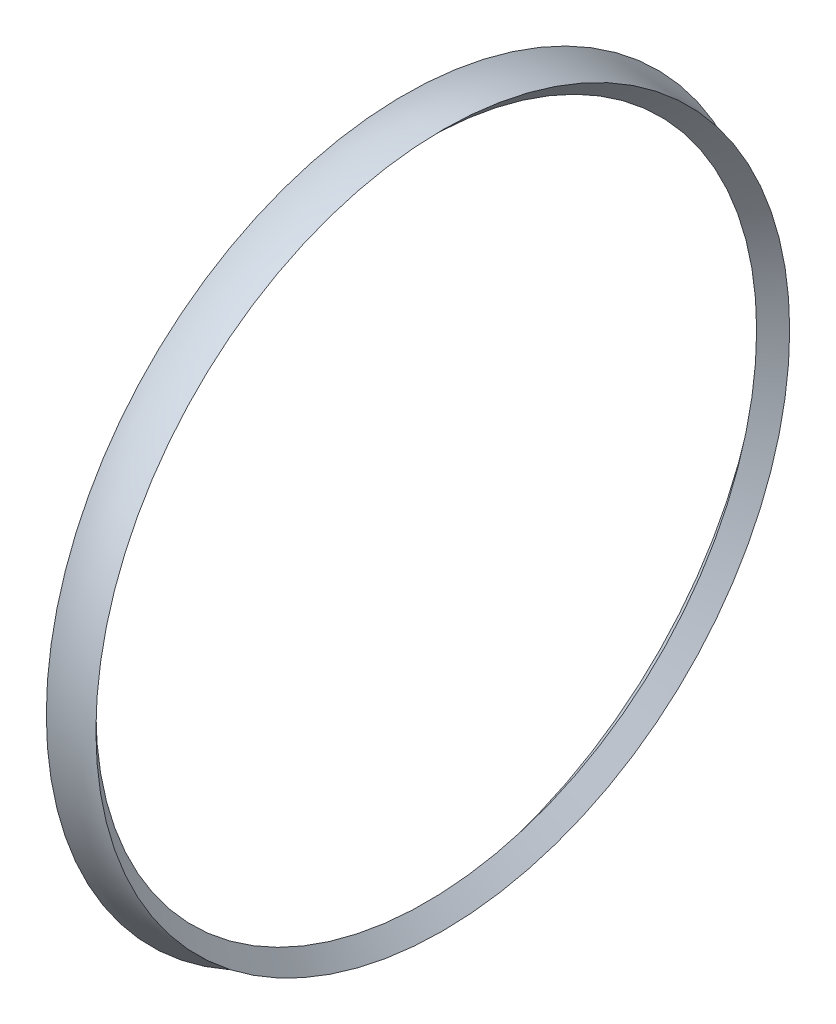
ISO-10303-21;
HEADER;
FILE_DESCRIPTION(('STEP AP214'),'2;1');
FILE_NAME('part.step','',(''),(''),'','','');
FILE_SCHEMA(('AUTOMOTIVE_DESIGN { 1 0 10303 214 1 1 1 1 }'));
ENDSEC;
DATA;
#1=APPLICATION_CONTEXT('core data for automotive mechanical design processes');
#2=APPLICATION_PROTOCOL_DEFINITION('international standard','automotive_design',2000,#1);
#3=PRODUCT_CONTEXT('',#1,'mechanical');
#4=PRODUCT('Part','Part','',(#3));
#5=PRODUCT_RELATED_PRODUCT_CATEGORY('part','',(#4));
#6=PRODUCT_DEFINITION_FORMATION('','',#4);
#7=PRODUCT_DEFINITION_CONTEXT('part definition',#1,'design');
#8=PRODUCT_DEFINITION('design','',#6,#7);
#9=PRODUCT_DEFINITION_SHAPE('','',#8);
#10=(LENGTH_UNIT() NAMED_UNIT(*) SI_UNIT(.MILLI.,.METRE.));
#11=(NAMED_UNIT(*) PLANE_ANGLE_UNIT() SI_UNIT($,.RADIAN.));
#12=(NAMED_UNIT(*) SI_UNIT($,.STERADIAN.) SOLID_ANGLE_UNIT());
#13=UNCERTAINTY_MEASURE_WITH_UNIT(LENGTH_MEASURE(1.E-05),#10,'distance_accuracy_value','');
#14=(GEOMETRIC_REPRESENTATION_CONTEXT(3) GLOBAL_UNCERTAINTY_ASSIGNED_CONTEXT((#13)) GLOBAL_UNIT_ASSIGNED_CONTEXT((#10,
#11,#12)) REPRESENTATION_CONTEXT('',''));
#15=CARTESIAN_POINT('',(0.,0.,0.));
#16=DIRECTION('',(0.,0.,1.));
#17=DIRECTION('',(1.,0.,0.));
#18=AXIS2_PLACEMENT_3D('',#15,#16,#17);
#19=CARTESIAN_POINT('',(8.49999999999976,-5.55111512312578E-13,0.));
#20=DIRECTION('',(-1.,0.,0.));
#21=DIRECTION('',(0.,0.,0.999999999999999));
#22=AXIS2_PLACEMENT_3D('',#19,#20,#21);
#23=TOROIDAL_SURFACE('',#22,38.1250000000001,6.62500000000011);
#24=CARTESIAN_POINT('',(5.00000000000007,0.,0.));
#25=DIRECTION('',(-1.,0.,0.));
#26=DIRECTION('',(0.,0.,0.999999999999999));
#27=AXIS2_PLACEMENT_3D('',#24,#25,#26);
#28=CIRCLE('',#27,32.5);
#29=CARTESIAN_POINT('',(5.00000000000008,0.,32.4999999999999));
#30=VERTEX_POINT('',#29);
#31=EDGE_CURVE('E10',#30,#30,#28,.T.);
#32=ORIENTED_EDGE('',*,*,#31,.F.);
#33=EDGE_LOOP('',(#32));
#34=FACE_BOUND('',#33,.T.);
#35=CARTESIAN_POINT('',(8.49999999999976,-5.55111512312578E-13,0.));
#36=DIRECTION('',(-1.,0.,0.));
#37=DIRECTION('',(0.,0.,0.999999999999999));
#38=AXIS2_PLACEMENT_3D('',#35,#36,#37);
#39=CIRCLE('',#38,31.5);
#40=CARTESIAN_POINT('',(8.49999999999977,-5.4811710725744E-13,31.5));
#41=VERTEX_POINT('',#40);
#42=EDGE_CURVE('E54',#41,#41,#39,.T.);
#43=ORIENTED_EDGE('',*,*,#42,.T.);
#44=EDGE_LOOP('',(#43));
#45=FACE_BOUND('',#44,.T.);
#46=ADVANCED_FACE('F40',(#34,#45),#23,.F.);
#47=CARTESIAN_POINT('',(5.00000000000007,0.,0.));
#48=DIRECTION('',(-1.,0.,0.));
#49=DIRECTION('',(0.,0.,0.999999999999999));
#50=AXIS2_PLACEMENT_3D('',#47,#48,#49);
#51=CONICAL_SURFACE('',#50,32.5,0.785398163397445);
#52=CARTESIAN_POINT('',(7.00000000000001,-1.38777878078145E-13,0.));
#53=DIRECTION('',(-1.,0.,0.));
#54=DIRECTION('',(0.,0.,0.999999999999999));
#55=AXIS2_PLACEMENT_3D('',#52,#53,#54);
#56=CIRCLE('',#55,30.5);
#57=CARTESIAN_POINT('',(7.00000000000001,-1.32005517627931E-13,30.4999999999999));
#58=VERTEX_POINT('',#57);
#59=EDGE_CURVE('E46',#58,#58,#56,.T.);
#60=ORIENTED_EDGE('',*,*,#59,.F.);
#61=EDGE_LOOP('',(#60));
#62=FACE_BOUND('',#61,.T.);
#63=ORIENTED_EDGE('',*,*,#31,.T.);
#64=EDGE_LOOP('',(#63));
#65=FACE_BOUND('',#64,.T.);
#66=ADVANCED_FACE('F69',(#62,#65),#51,.F.);
#67=CARTESIAN_POINT('',(6.9999999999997,29.9999999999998,0.));
#68=DIRECTION('',(1.,0.,0.));
#69=DIRECTION('',(0.,0.,-0.999999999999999));
#70=AXIS2_PLACEMENT_3D('',#67,#68,#69);
#71=PLANE('',#70);
#72=CARTESIAN_POINT('',(7.00000000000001,-1.38777878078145E-13,0.));
#73=DIRECTION('',(-1.,0.,0.));
#74=DIRECTION('',(0.,0.,0.999999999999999));
#75=AXIS2_PLACEMENT_3D('',#72,#73,#74);
#76=CIRCLE('',#75,30.);
#77=CARTESIAN_POINT('',(7.00000000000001,-1.32116539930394E-13,29.9999999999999));
#78=VERTEX_POINT('',#77);
#79=EDGE_CURVE('E50',#78,#78,#76,.T.);
#80=ORIENTED_EDGE('',*,*,#79,.F.);
#81=EDGE_LOOP('',(#80));
#82=FACE_BOUND('',#81,.T.);
#83=ORIENTED_EDGE('',*,*,#59,.T.);
#84=EDGE_LOOP('',(#83));
#85=FACE_BOUND('',#84,.T.);
#86=ADVANCED_FACE('F64',(#82,#85),#71,.F.);
#87=CARTESIAN_POINT('',(7.00000000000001,-1.38777878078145E-13,0.));
#88=DIRECTION('',(1.,0.,0.));
#89=DIRECTION('',(0.,0.,-0.999999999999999));
#90=AXIS2_PLACEMENT_3D('',#87,#88,#89);
#91=CONICAL_SURFACE('',#90,30.,0.785398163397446);
#92=ORIENTED_EDGE('',*,*,#42,.F.);
#93=EDGE_LOOP('',(#92));
#94=FACE_BOUND('',#93,.T.);
#95=ORIENTED_EDGE('',*,*,#79,.T.);
#96=EDGE_LOOP('',(#95));
#97=FACE_BOUND('',#96,.T.);
#98=ADVANCED_FACE('F61',(#94,#97),#91,.F.);
#99=CLOSED_SHELL('',(#46,#66,#86,#98));
#100=MANIFOLD_SOLID_BREP('B2',#99);
#101=ADVANCED_BREP_SHAPE_REPRESENTATION('',(#18,#100),#14);
#102=SHAPE_DEFINITION_REPRESENTATION(#9,#101);
ENDSEC;
END-ISO-10303-21;
